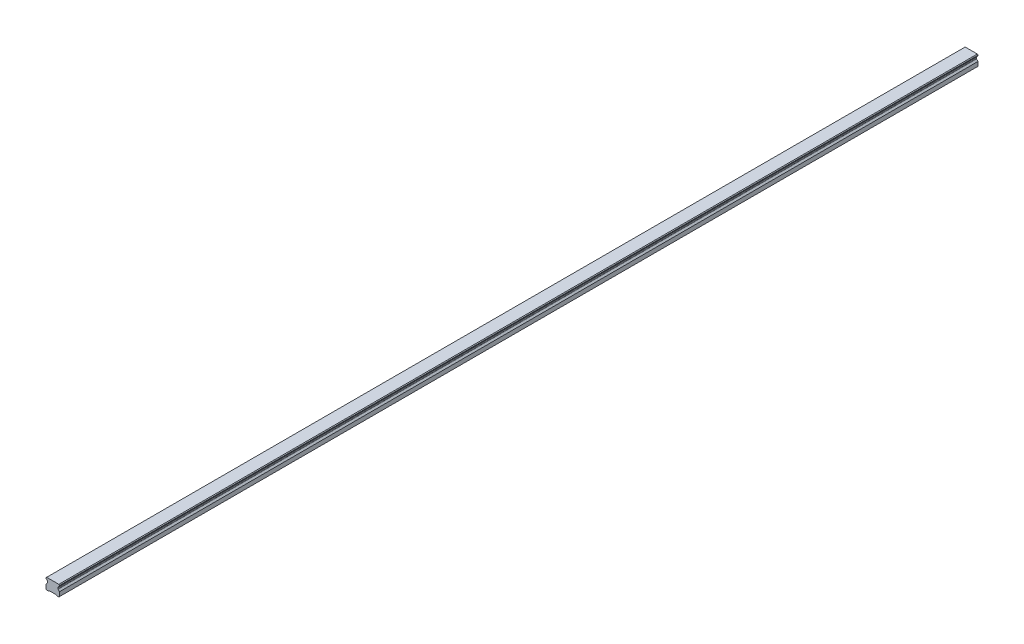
from build123d import *

# Parameters (mm, degrees)
SKETCH1_W           = 20
SKETCH1_H           = 16.3
BOSS_EXTRUDE1_DEPTH = 680
CUT_EXTRUDE1_DEPTH  = 1361.134438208
CHAMFER1_SIZE       = 1
FILLET1_R           = 1
CUT_EXTRUDE2_DEPTH  = 1361.134438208
SKETCH5_R           = 3
SKETCH5_R_2         = 2.5
CUT_EXTRUDE5_DEPTH  = 10
SKETCH5_2_R         = 2.5
CUT_EXTRUDE6_DEPTH  = 13
LPATTERN2_COUNT     = 23
LPATTERN2_PITCH     = 60


with BuildPart() as part:
    # Sketch1 → Boss-Extrude1 (new, symmetric)
    with BuildSketch(Plane.XY):
        with Locations((0, 8.15)):
            Rectangle(SKETCH1_W, SKETCH1_H)
    extrude(amount=BOSS_EXTRUDE1_DEPTH, both=True)

    # Sketch2 → Cut-Extrude1 (cut, through all)
    with BuildSketch(Plane.XY.offset(680)):
        Polygon((-10, 14.3), (-10, 7.3), (-7.666666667, 9.633333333), (-7.666666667, 11.966666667), align=None)
        Polygon((7.666666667, 11.966666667), (10, 14.3), (10, 7.3), (7.666666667, 9.633333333), align=None)
    extrude(amount=-CUT_EXTRUDE1_DEPTH, mode=Mode.SUBTRACT)

    # Chamfer1
    chamfer1_edges = [part.edges().sort_by_distance(p)[0] for p in [
        (-10, 16.3, 0),
        (10, 16.3, 0),
        (10, 0, 0),
        (-10, 0, 0),
    ]]
    chamfer(chamfer1_edges, length=CHAMFER1_SIZE)

    # Fillet1
    fillet1_edges = [part.edges().sort_by_distance(p)[0] for p in [
        (-7.666666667, 11.966666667, 0),
        (-7.666666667, 9.633333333, 0),
        (7.666666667, 9.633333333, 0),
        (7.666666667, 11.966666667, 0),
    ]]
    fillet(fillet1_edges, radius=FILLET1_R)

    # Sketch3 → Cut-Extrude2 (cut, through all)
    with BuildSketch(Plane.XY.offset(680)):
        Polygon((-6, 0), (-5, 1), (5, 1), (6, 0), align=None)
    extrude(amount=-CUT_EXTRUDE2_DEPTH, mode=Mode.SUBTRACT)

    # Sketch5 → Cut-Extrude5 (cut)
    with BuildSketch(Plane.XZ.offset(-1)):
        with Locations(Location((0, 660, 0), (0, 0, 270))):
            Circle(SKETCH5_R)
        with Locations(Location((0, 660, 0), (0, 0, 270))):
            Circle(SKETCH5_R_2, mode=Mode.SUBTRACT)
    cut_extrude5 = extrude(amount=-CUT_EXTRUDE5_DEPTH, mode=Mode.SUBTRACT)

    # Sketch5_2 → Cut-Extrude6 (cut)
    with BuildSketch(Plane.XZ.offset(-1)):
        with Locations(Location((0, 660, 0), (0, 0, 270))):
            Circle(SKETCH5_2_R)
    cut_extrude6 = extrude(amount=-CUT_EXTRUDE6_DEPTH, mode=Mode.SUBTRACT)

    # Cut-Extrude7 cone 1 section (on through the dimple's axis) → Cut-Extrude7 (revolve, cut)
    with BuildSketch(Plane(origin=(0, 14, 660), x_dir=(0, 0, -1), z_dir=(1, 0, 0))):
        Polygon((0, 0), (2.5, 0), (0, 1.443375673), align=None)
    cut_extrude7 = revolve(axis=Axis((0, 14, 660), (0, 1, 0)), mode=Mode.SUBTRACT)

    # LPattern2: Cut-Extrude5, Cut-Extrude6, Cut-Extrude7 ×23
    with Locations(*[(0, 0, -i * LPATTERN2_PITCH) for i in range(1, LPATTERN2_COUNT)]):
        add(cut_extrude5, mode=Mode.SUBTRACT)
        add(cut_extrude6, mode=Mode.SUBTRACT)
        add(cut_extrude7, mode=Mode.SUBTRACT)


solid = part.part
